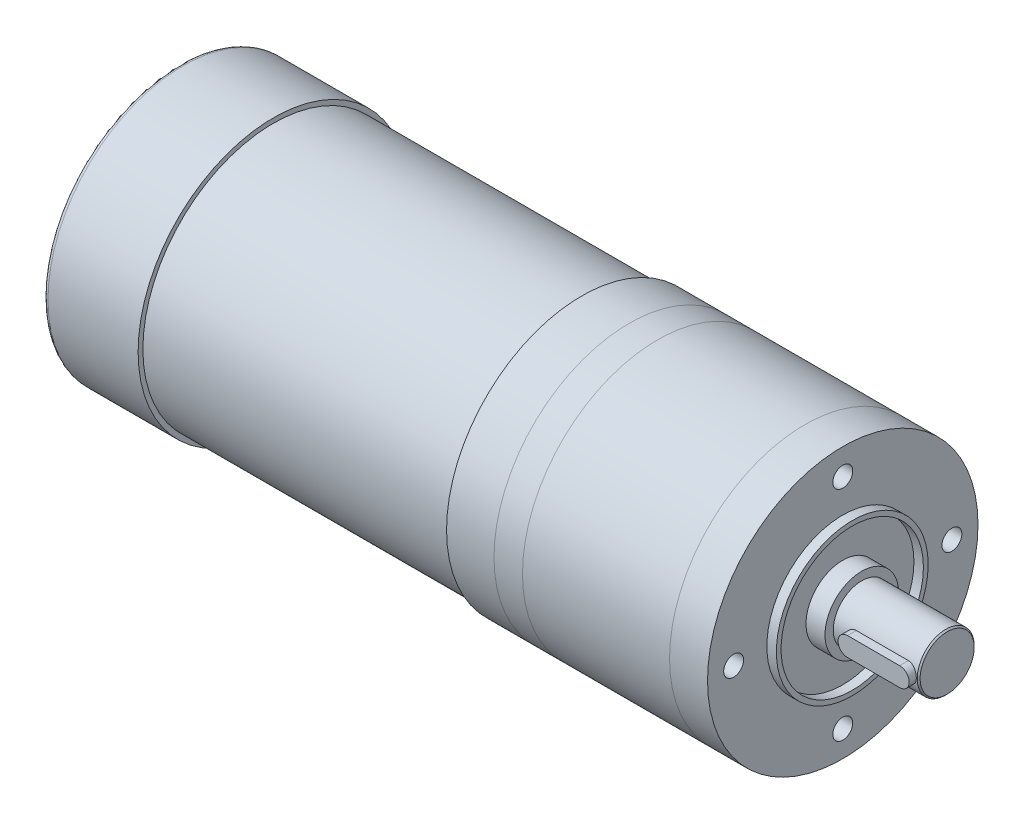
ISO-10303-21;
HEADER;
FILE_DESCRIPTION(('STEP AP214'),'2;1');
FILE_NAME('part.step','',(''),(''),'','','');
FILE_SCHEMA(('AUTOMOTIVE_DESIGN { 1 0 10303 214 1 1 1 1 }'));
ENDSEC;
DATA;
#1=APPLICATION_CONTEXT('core data for automotive mechanical design processes');
#2=APPLICATION_PROTOCOL_DEFINITION('international standard','automotive_design',2000,#1);
#3=PRODUCT_CONTEXT('',#1,'mechanical');
#4=PRODUCT('Part','Part','',(#3));
#5=PRODUCT_RELATED_PRODUCT_CATEGORY('part','',(#4));
#6=PRODUCT_DEFINITION_FORMATION('','',#4);
#7=PRODUCT_DEFINITION_CONTEXT('part definition',#1,'design');
#8=PRODUCT_DEFINITION('design','',#6,#7);
#9=PRODUCT_DEFINITION_SHAPE('','',#8);
#10=(LENGTH_UNIT() NAMED_UNIT(*) SI_UNIT(.MILLI.,.METRE.));
#11=(NAMED_UNIT(*) PLANE_ANGLE_UNIT() SI_UNIT($,.RADIAN.));
#12=(NAMED_UNIT(*) SI_UNIT($,.STERADIAN.) SOLID_ANGLE_UNIT());
#13=UNCERTAINTY_MEASURE_WITH_UNIT(LENGTH_MEASURE(1.E-05),#10,'distance_accuracy_value','');
#14=(GEOMETRIC_REPRESENTATION_CONTEXT(3) GLOBAL_UNCERTAINTY_ASSIGNED_CONTEXT((#13)) GLOBAL_UNIT_ASSIGNED_CONTEXT((#10,
#11,#12)) REPRESENTATION_CONTEXT('',''));
#15=CARTESIAN_POINT('',(0.,0.,0.));
#16=DIRECTION('',(0.,0.,1.));
#17=DIRECTION('',(1.,0.,0.));
#18=AXIS2_PLACEMENT_3D('',#15,#16,#17);
#19=CARTESIAN_POINT('',(8.5,0.,7.5));
#20=DIRECTION('',(0.,0.,-1.));
#21=DIRECTION('',(-1.,0.,0.));
#22=AXIS2_PLACEMENT_3D('',#19,#20,#21);
#23=CYLINDRICAL_SURFACE('',#22,2.);
#24=CARTESIAN_POINT('',(8.5,0.,3.5));
#25=DIRECTION('',(0.,0.,1.));
#26=DIRECTION('',(1.,0.,0.));
#27=AXIS2_PLACEMENT_3D('',#24,#25,#26);
#28=CIRCLE('',#27,2.);
#29=CARTESIAN_POINT('',(8.5,2.,3.5));
#30=VERTEX_POINT('',#29);
#31=CARTESIAN_POINT('',(8.5,-2.,3.5));
#32=VERTEX_POINT('',#31);
#33=EDGE_CURVE('E108',#30,#32,#28,.T.);
#34=ORIENTED_EDGE('',*,*,#33,.T.);
#35=DIRECTION('',(0.,0.,-1.));
#36=VECTOR('',#35,1.);
#37=CARTESIAN_POINT('',(8.5,-2.,7.5));
#38=LINE('',#37,#36);
#39=CARTESIAN_POINT('',(8.5,-2.,7.5));
#40=VERTEX_POINT('',#39);
#41=EDGE_CURVE('E12',#40,#32,#38,.T.);
#42=ORIENTED_EDGE('',*,*,#41,.F.);
#43=CARTESIAN_POINT('',(8.5,0.,7.5));
#44=DIRECTION('',(0.,0.,1.));
#45=DIRECTION('',(1.,0.,0.));
#46=AXIS2_PLACEMENT_3D('',#43,#44,#45);
#47=CIRCLE('',#46,2.);
#48=CARTESIAN_POINT('',(8.5,2.,7.5));
#49=VERTEX_POINT('',#48);
#50=EDGE_CURVE('E96',#49,#40,#47,.T.);
#51=ORIENTED_EDGE('',*,*,#50,.F.);
#52=DIRECTION('',(0.,0.,-1.));
#53=VECTOR('',#52,1.);
#54=CARTESIAN_POINT('',(8.5,2.,7.5));
#55=LINE('',#54,#53);
#56=EDGE_CURVE('E104',#49,#30,#55,.T.);
#57=ORIENTED_EDGE('',*,*,#56,.T.);
#58=EDGE_LOOP('',(#34,#42,#51,#57));
#59=FACE_BOUND('',#58,.T.);
#60=ADVANCED_FACE('F45',(#59),#23,.T.);
#61=CARTESIAN_POINT('',(19.5,-2.,7.5));
#62=DIRECTION('',(0.,1.,0.));
#63=DIRECTION('',(-1.,0.,0.));
#64=AXIS2_PLACEMENT_3D('',#61,#62,#63);
#65=PLANE('',#64);
#66=DIRECTION('',(1.,0.,0.));
#67=VECTOR('',#66,1.);
#68=CARTESIAN_POINT('',(19.5,-2.,3.5));
#69=LINE('',#68,#67);
#70=CARTESIAN_POINT('',(19.5,-2.,3.5));
#71=VERTEX_POINT('',#70);
#72=EDGE_CURVE('E100',#32,#71,#69,.T.);
#73=ORIENTED_EDGE('',*,*,#72,.T.);
#74=DIRECTION('',(0.,0.,-1.));
#75=VECTOR('',#74,1.);
#76=CARTESIAN_POINT('',(19.5,-2.,7.5));
#77=LINE('',#76,#75);
#78=CARTESIAN_POINT('',(19.5,-2.,7.5));
#79=VERTEX_POINT('',#78);
#80=EDGE_CURVE('E53',#79,#71,#77,.T.);
#81=ORIENTED_EDGE('',*,*,#80,.F.);
#82=DIRECTION('',(1.,0.,0.));
#83=VECTOR('',#82,1.);
#84=CARTESIAN_POINT('',(19.5,-2.,7.5));
#85=LINE('',#84,#83);
#86=EDGE_CURVE('E91',#40,#79,#85,.T.);
#87=ORIENTED_EDGE('',*,*,#86,.F.);
#88=ORIENTED_EDGE('',*,*,#41,.T.);
#89=EDGE_LOOP('',(#73,#81,#87,#88));
#90=FACE_BOUND('',#89,.T.);
#91=ADVANCED_FACE('F99',(#90),#65,.F.);
#92=CARTESIAN_POINT('',(19.5,0.,7.5));
#93=DIRECTION('',(0.,0.,-1.));
#94=DIRECTION('',(-1.,0.,0.));
#95=AXIS2_PLACEMENT_3D('',#92,#93,#94);
#96=CYLINDRICAL_SURFACE('',#95,2.);
#97=CARTESIAN_POINT('',(19.5,0.,3.5));
#98=DIRECTION('',(0.,0.,1.));
#99=DIRECTION('',(1.,0.,0.));
#100=AXIS2_PLACEMENT_3D('',#97,#98,#99);
#101=CIRCLE('',#100,2.);
#102=CARTESIAN_POINT('',(19.5,2.,3.5));
#103=VERTEX_POINT('',#102);
#104=EDGE_CURVE('E78',#71,#103,#101,.T.);
#105=ORIENTED_EDGE('',*,*,#104,.T.);
#106=DIRECTION('',(0.,0.,-1.));
#107=VECTOR('',#106,1.);
#108=CARTESIAN_POINT('',(19.5,2.,7.5));
#109=LINE('',#108,#107);
#110=CARTESIAN_POINT('',(19.5,2.,7.5));
#111=VERTEX_POINT('',#110);
#112=EDGE_CURVE('E101',#111,#103,#109,.T.);
#113=ORIENTED_EDGE('',*,*,#112,.F.);
#114=CARTESIAN_POINT('',(19.5,0.,7.5));
#115=DIRECTION('',(0.,0.,1.));
#116=DIRECTION('',(1.,0.,0.));
#117=AXIS2_PLACEMENT_3D('',#114,#115,#116);
#118=CIRCLE('',#117,2.);
#119=EDGE_CURVE('E94',#79,#111,#118,.T.);
#120=ORIENTED_EDGE('',*,*,#119,.F.);
#121=ORIENTED_EDGE('',*,*,#80,.T.);
#122=EDGE_LOOP('',(#105,#113,#120,#121));
#123=FACE_BOUND('',#122,.T.);
#124=ADVANCED_FACE('F102',(#123),#96,.T.);
#125=CARTESIAN_POINT('',(8.5,2.,7.5));
#126=DIRECTION('',(0.,-1.,0.));
#127=DIRECTION('',(1.,0.,0.));
#128=AXIS2_PLACEMENT_3D('',#125,#126,#127);
#129=PLANE('',#128);
#130=DIRECTION('',(-1.,0.,0.));
#131=VECTOR('',#130,1.);
#132=CARTESIAN_POINT('',(8.5,2.,3.5));
#133=LINE('',#132,#131);
#134=EDGE_CURVE('E84',#103,#30,#133,.T.);
#135=ORIENTED_EDGE('',*,*,#134,.T.);
#136=ORIENTED_EDGE('',*,*,#56,.F.);
#137=DIRECTION('',(-1.,0.,0.));
#138=VECTOR('',#137,1.);
#139=CARTESIAN_POINT('',(8.5,2.,7.5));
#140=LINE('',#139,#138);
#141=EDGE_CURVE('E61',#111,#49,#140,.T.);
#142=ORIENTED_EDGE('',*,*,#141,.F.);
#143=ORIENTED_EDGE('',*,*,#112,.T.);
#144=EDGE_LOOP('',(#135,#136,#142,#143));
#145=FACE_BOUND('',#144,.T.);
#146=ADVANCED_FACE('F115',(#145),#129,.F.);
#147=CARTESIAN_POINT('',(8.5,0.,7.5));
#148=DIRECTION('',(0.,0.,1.));
#149=DIRECTION('',(1.,0.,0.));
#150=AXIS2_PLACEMENT_3D('',#147,#148,#149);
#151=PLANE('',#150);
#152=ORIENTED_EDGE('',*,*,#50,.T.);
#153=ORIENTED_EDGE('',*,*,#86,.T.);
#154=ORIENTED_EDGE('',*,*,#119,.T.);
#155=ORIENTED_EDGE('',*,*,#141,.T.);
#156=EDGE_LOOP('',(#152,#153,#154,#155));
#157=FACE_BOUND('',#156,.T.);
#158=ADVANCED_FACE('F92',(#157),#151,.T.);
#159=CARTESIAN_POINT('',(8.5,0.,3.5));
#160=DIRECTION('',(0.,0.,1.));
#161=DIRECTION('',(1.,0.,0.));
#162=AXIS2_PLACEMENT_3D('',#159,#160,#161);
#163=PLANE('',#162);
#164=ORIENTED_EDGE('',*,*,#33,.F.);
#165=ORIENTED_EDGE('',*,*,#134,.F.);
#166=ORIENTED_EDGE('',*,*,#104,.F.);
#167=ORIENTED_EDGE('',*,*,#72,.F.);
#168=EDGE_LOOP('',(#164,#165,#166,#167));
#169=FACE_BOUND('',#168,.T.);
#170=ADVANCED_FACE('F118',(#169),#163,.F.);
#171=CLOSED_SHELL('',(#60,#91,#124,#146,#158,#170));
#172=MANIFOLD_SOLID_BREP('B2',#171);
#173=CARTESIAN_POINT('',(-55.,0.,0.));
#174=DIRECTION('',(-1.,0.,0.));
#175=DIRECTION('',(0.,0.,1.));
#176=AXIS2_PLACEMENT_3D('',#173,#174,#175);
#177=PLANE('',#176);
#178=CARTESIAN_POINT('',(-55.,0.,0.));
#179=DIRECTION('',(-1.,0.,0.));
#180=DIRECTION('',(0.,0.,1.));
#181=AXIS2_PLACEMENT_3D('',#178,#179,#180);
#182=CIRCLE('',#181,28.5);
#183=CARTESIAN_POINT('',(-55.,0.,28.5));
#184=VERTEX_POINT('',#183);
#185=EDGE_CURVE('E187',#184,#184,#182,.T.);
#186=ORIENTED_EDGE('',*,*,#185,.T.);
#187=EDGE_LOOP('',(#186));
#188=FACE_BOUND('',#187,.T.);
#189=CARTESIAN_POINT('',(-55.,0.,0.));
#190=DIRECTION('',(-1.,0.,0.));
#191=DIRECTION('',(0.,0.,1.));
#192=AXIS2_PLACEMENT_3D('',#189,#190,#191);
#193=CIRCLE('',#192,27.5);
#194=CARTESIAN_POINT('',(-55.,0.,27.5));
#195=VERTEX_POINT('',#194);
#196=EDGE_CURVE('E197',#195,#195,#193,.T.);
#197=ORIENTED_EDGE('',*,*,#196,.F.);
#198=EDGE_LOOP('',(#197));
#199=FACE_BOUND('',#198,.T.);
#200=ADVANCED_FACE('F176',(#188,#199),#177,.T.);
#201=CARTESIAN_POINT('',(-55.,0.,0.));
#202=DIRECTION('',(1.,0.,0.));
#203=DIRECTION('',(0.,0.,-1.));
#204=AXIS2_PLACEMENT_3D('',#201,#202,#203);
#205=CYLINDRICAL_SURFACE('',#204,28.5);
#206=ORIENTED_EDGE('',*,*,#185,.F.);
#207=EDGE_LOOP('',(#206));
#208=FACE_BOUND('',#207,.T.);
#209=CARTESIAN_POINT('',(-45.,0.,0.));
#210=DIRECTION('',(-1.,0.,0.));
#211=DIRECTION('',(0.,0.,1.));
#212=AXIS2_PLACEMENT_3D('',#209,#210,#211);
#213=CIRCLE('',#212,28.5);
#214=CARTESIAN_POINT('',(-45.,0.,28.5));
#215=VERTEX_POINT('',#214);
#216=EDGE_CURVE('E191',#215,#215,#213,.T.);
#217=ORIENTED_EDGE('',*,*,#216,.T.);
#218=EDGE_LOOP('',(#217));
#219=FACE_BOUND('',#218,.T.);
#220=ADVANCED_FACE('F222',(#208,#219),#205,.T.);
#221=CARTESIAN_POINT('',(-45.,0.,0.));
#222=DIRECTION('',(-1.,0.,0.));
#223=DIRECTION('',(0.,0.,1.));
#224=AXIS2_PLACEMENT_3D('',#221,#222,#223);
#225=PLANE('',#224);
#226=ORIENTED_EDGE('',*,*,#216,.F.);
#227=EDGE_LOOP('',(#226));
#228=FACE_BOUND('',#227,.T.);
#229=ADVANCED_FACE('F217',(#228),#225,.F.);
#230=CARTESIAN_POINT('',(-120.,0.,0.));
#231=DIRECTION('',(1.,0.,0.));
#232=DIRECTION('',(0.,0.,-1.));
#233=AXIS2_PLACEMENT_3D('',#230,#231,#232);
#234=CYLINDRICAL_SURFACE('',#233,27.5);
#235=CARTESIAN_POINT('',(-120.,0.,0.));
#236=DIRECTION('',(-1.,0.,0.));
#237=DIRECTION('',(0.,0.,1.));
#238=AXIS2_PLACEMENT_3D('',#235,#236,#237);
#239=CIRCLE('',#238,27.5);
#240=CARTESIAN_POINT('',(-120.,0.,27.5));
#241=VERTEX_POINT('',#240);
#242=EDGE_CURVE('E195',#241,#241,#239,.T.);
#243=ORIENTED_EDGE('',*,*,#242,.F.);
#244=EDGE_LOOP('',(#243));
#245=FACE_BOUND('',#244,.T.);
#246=ORIENTED_EDGE('',*,*,#196,.T.);
#247=EDGE_LOOP('',(#246));
#248=FACE_BOUND('',#247,.T.);
#249=ADVANCED_FACE('F211',(#245,#248),#234,.T.);
#250=CARTESIAN_POINT('',(-120.,0.,0.));
#251=DIRECTION('',(-1.,0.,0.));
#252=DIRECTION('',(0.,0.,1.));
#253=AXIS2_PLACEMENT_3D('',#250,#251,#252);
#254=PLANE('',#253);
#255=CARTESIAN_POINT('',(-120.,0.,0.));
#256=DIRECTION('',(-1.,0.,0.));
#257=DIRECTION('',(0.,0.,1.));
#258=AXIS2_PLACEMENT_3D('',#255,#256,#257);
#259=CIRCLE('',#258,28.5);
#260=CARTESIAN_POINT('',(-120.,0.,28.5));
#261=VERTEX_POINT('',#260);
#262=EDGE_CURVE('E200',#261,#261,#259,.T.);
#263=ORIENTED_EDGE('',*,*,#262,.F.);
#264=EDGE_LOOP('',(#263));
#265=FACE_BOUND('',#264,.T.);
#266=ORIENTED_EDGE('',*,*,#242,.T.);
#267=EDGE_LOOP('',(#266));
#268=FACE_BOUND('',#267,.T.);
#269=ADVANCED_FACE('F208',(#265,#268),#254,.F.);
#270=CARTESIAN_POINT('',(-140.,0.,0.));
#271=DIRECTION('',(1.,0.,0.));
#272=DIRECTION('',(0.,0.,-1.));
#273=AXIS2_PLACEMENT_3D('',#270,#271,#272);
#274=CYLINDRICAL_SURFACE('',#273,28.5);
#275=CARTESIAN_POINT('',(-139.,0.,0.));
#276=DIRECTION('',(-1.,0.,0.));
#277=DIRECTION('',(0.,0.,1.));
#278=AXIS2_PLACEMENT_3D('',#275,#276,#277);
#279=CIRCLE('',#278,28.5);
#280=CARTESIAN_POINT('',(-139.,0.,28.5));
#281=VERTEX_POINT('',#280);
#282=EDGE_CURVE('E44',#281,#281,#279,.F.);
#283=ORIENTED_EDGE('',*,*,#282,.T.);
#284=EDGE_LOOP('',(#283));
#285=FACE_BOUND('',#284,.T.);
#286=ORIENTED_EDGE('',*,*,#262,.T.);
#287=EDGE_LOOP('',(#286));
#288=FACE_BOUND('',#287,.T.);
#289=ADVANCED_FACE('F206',(#285,#288),#274,.T.);
#290=CARTESIAN_POINT('',(-140.,0.,0.));
#291=DIRECTION('',(-1.,0.,0.));
#292=DIRECTION('',(0.,0.,1.));
#293=AXIS2_PLACEMENT_3D('',#290,#291,#292);
#294=PLANE('',#293);
#295=CARTESIAN_POINT('',(-140.,0.,0.));
#296=DIRECTION('',(-1.,0.,0.));
#297=DIRECTION('',(0.,0.,1.));
#298=AXIS2_PLACEMENT_3D('',#295,#296,#297);
#299=CIRCLE('',#298,27.5);
#300=CARTESIAN_POINT('',(-140.,0.,27.5));
#301=VERTEX_POINT('',#300);
#302=EDGE_CURVE('E183',#301,#301,#299,.T.);
#303=ORIENTED_EDGE('',*,*,#302,.T.);
#304=EDGE_LOOP('',(#303));
#305=FACE_BOUND('',#304,.T.);
#306=ADVANCED_FACE('F253',(#305),#294,.T.);
#307=CARTESIAN_POINT('',(-139.,0.,0.));
#308=DIRECTION('',(-1.,0.,0.));
#309=DIRECTION('',(0.,0.,1.));
#310=AXIS2_PLACEMENT_3D('',#307,#308,#309);
#311=TOROIDAL_SURFACE('',#310,27.5,1.);
#312=ORIENTED_EDGE('',*,*,#282,.F.);
#313=EDGE_LOOP('',(#312));
#314=FACE_BOUND('',#313,.T.);
#315=ORIENTED_EDGE('',*,*,#302,.F.);
#316=EDGE_LOOP('',(#315));
#317=FACE_BOUND('',#316,.T.);
#318=ADVANCED_FACE('F178',(#314,#317),#311,.T.);
#319=CLOSED_SHELL('',(#200,#220,#229,#249,#269,#289,#306,#318));
#320=MANIFOLD_SOLID_BREP('B6',#319);
#321=CARTESIAN_POINT('',(-45.,0.,0.));
#322=DIRECTION('',(1.,0.,0.));
#323=DIRECTION('',(0.,0.,-1.));
#324=AXIS2_PLACEMENT_3D('',#321,#322,#323);
#325=CYLINDRICAL_SURFACE('',#324,28.5);
#326=CARTESIAN_POINT('',(-45.,0.,0.));
#327=DIRECTION('',(-1.,0.,0.));
#328=DIRECTION('',(0.,0.,1.));
#329=AXIS2_PLACEMENT_3D('',#326,#327,#328);
#330=CIRCLE('',#329,28.5);
#331=CARTESIAN_POINT('',(-45.,0.,28.5));
#332=VERTEX_POINT('',#331);
#333=EDGE_CURVE('E175',#332,#332,#330,.T.);
#334=ORIENTED_EDGE('',*,*,#333,.F.);
#335=EDGE_LOOP('',(#334));
#336=FACE_BOUND('',#335,.T.);
#337=CARTESIAN_POINT('',(-39.,0.,0.));
#338=DIRECTION('',(-1.,0.,0.));
#339=DIRECTION('',(0.,0.,1.));
#340=AXIS2_PLACEMENT_3D('',#337,#338,#339);
#341=CIRCLE('',#340,28.5);
#342=CARTESIAN_POINT('',(-39.,0.,28.5));
#343=VERTEX_POINT('',#342);
#344=EDGE_CURVE('E304',#343,#343,#341,.T.);
#345=ORIENTED_EDGE('',*,*,#344,.T.);
#346=EDGE_LOOP('',(#345));
#347=FACE_BOUND('',#346,.T.);
#348=ADVANCED_FACE('F301',(#336,#347),#325,.T.);
#349=CARTESIAN_POINT('',(-45.,0.,0.));
#350=DIRECTION('',(-1.,0.,0.));
#351=DIRECTION('',(0.,0.,1.));
#352=AXIS2_PLACEMENT_3D('',#349,#350,#351);
#353=PLANE('',#352);
#354=ORIENTED_EDGE('',*,*,#333,.T.);
#355=EDGE_LOOP('',(#354));
#356=FACE_BOUND('',#355,.T.);
#357=ADVANCED_FACE('F316',(#356),#353,.T.);
#358=CARTESIAN_POINT('',(-39.,0.,0.));
#359=DIRECTION('',(-1.,0.,0.));
#360=DIRECTION('',(0.,0.,1.));
#361=AXIS2_PLACEMENT_3D('',#358,#359,#360);
#362=PLANE('',#361);
#363=ORIENTED_EDGE('',*,*,#344,.F.);
#364=EDGE_LOOP('',(#363));
#365=FACE_BOUND('',#364,.T.);
#366=ADVANCED_FACE('F314',(#365),#362,.F.);
#367=CLOSED_SHELL('',(#348,#357,#366));
#368=MANIFOLD_SOLID_BREP('B39',#367);
#369=CARTESIAN_POINT('',(-39.,0.,0.));
#370=DIRECTION('',(1.,0.,0.));
#371=DIRECTION('',(0.,0.,-1.));
#372=AXIS2_PLACEMENT_3D('',#369,#370,#371);
#373=CYLINDRICAL_SURFACE('',#372,28.5);
#374=CARTESIAN_POINT('',(-39.,0.,0.));
#375=DIRECTION('',(-1.,0.,0.));
#376=DIRECTION('',(0.,0.,1.));
#377=AXIS2_PLACEMENT_3D('',#374,#375,#376);
#378=CIRCLE('',#377,28.5);
#379=CARTESIAN_POINT('',(-39.,0.,28.5));
#380=VERTEX_POINT('',#379);
#381=EDGE_CURVE('E299',#380,#380,#378,.T.);
#382=ORIENTED_EDGE('',*,*,#381,.F.);
#383=EDGE_LOOP('',(#382));
#384=FACE_BOUND('',#383,.T.);
#385=CARTESIAN_POINT('',(-8.,0.,0.));
#386=DIRECTION('',(-1.,0.,0.));
#387=DIRECTION('',(0.,0.,1.));
#388=AXIS2_PLACEMENT_3D('',#385,#386,#387);
#389=CIRCLE('',#388,28.5);
#390=CARTESIAN_POINT('',(-8.,0.,28.5));
#391=VERTEX_POINT('',#390);
#392=EDGE_CURVE('E358',#391,#391,#389,.T.);
#393=ORIENTED_EDGE('',*,*,#392,.T.);
#394=EDGE_LOOP('',(#393));
#395=FACE_BOUND('',#394,.T.);
#396=ADVANCED_FACE('F350',(#384,#395),#373,.T.);
#397=CARTESIAN_POINT('',(-39.,0.,0.));
#398=DIRECTION('',(-1.,0.,0.));
#399=DIRECTION('',(0.,0.,1.));
#400=AXIS2_PLACEMENT_3D('',#397,#398,#399);
#401=PLANE('',#400);
#402=ORIENTED_EDGE('',*,*,#381,.T.);
#403=EDGE_LOOP('',(#402));
#404=FACE_BOUND('',#403,.T.);
#405=ADVANCED_FACE('F423',(#404),#401,.T.);
#406=CARTESIAN_POINT('',(-8.,0.,0.));
#407=DIRECTION('',(-1.,0.,0.));
#408=DIRECTION('',(0.,0.,1.));
#409=AXIS2_PLACEMENT_3D('',#406,#407,#408);
#410=PLANE('',#409);
#411=CARTESIAN_POINT('',(-8.,23.,0.));
#412=DIRECTION('',(-1.,0.,0.));
#413=DIRECTION('',(0.,0.,1.));
#414=AXIS2_PLACEMENT_3D('',#411,#412,#413);
#415=CIRCLE('',#414,2.1);
#416=CARTESIAN_POINT('',(-8.,23.,2.1));
#417=VERTEX_POINT('',#416);
#418=EDGE_CURVE('E353',#417,#417,#415,.T.);
#419=ORIENTED_EDGE('',*,*,#418,.T.);
#420=EDGE_LOOP('',(#419));
#421=FACE_BOUND('',#420,.T.);
#422=CARTESIAN_POINT('',(-8.,0.,-23.));
#423=DIRECTION('',(-1.,0.,0.));
#424=DIRECTION('',(0.,0.,1.));
#425=AXIS2_PLACEMENT_3D('',#422,#423,#424);
#426=CIRCLE('',#425,2.1);
#427=CARTESIAN_POINT('',(-8.,0.,-20.9));
#428=VERTEX_POINT('',#427);
#429=EDGE_CURVE('E387',#428,#428,#426,.T.);
#430=ORIENTED_EDGE('',*,*,#429,.T.);
#431=EDGE_LOOP('',(#430));
#432=FACE_BOUND('',#431,.T.);
#433=CARTESIAN_POINT('',(-8.,-23.,0.));
#434=DIRECTION('',(-1.,0.,0.));
#435=DIRECTION('',(0.,0.,1.));
#436=AXIS2_PLACEMENT_3D('',#433,#434,#435);
#437=CIRCLE('',#436,2.1);
#438=CARTESIAN_POINT('',(-8.,-23.,2.1));
#439=VERTEX_POINT('',#438);
#440=EDGE_CURVE('E391',#439,#439,#437,.T.);
#441=ORIENTED_EDGE('',*,*,#440,.T.);
#442=EDGE_LOOP('',(#441));
#443=FACE_BOUND('',#442,.T.);
#444=CARTESIAN_POINT('',(-8.,0.,23.));
#445=DIRECTION('',(-1.,0.,0.));
#446=DIRECTION('',(0.,0.,1.));
#447=AXIS2_PLACEMENT_3D('',#444,#445,#446);
#448=CIRCLE('',#447,2.1);
#449=CARTESIAN_POINT('',(-8.,0.,25.1));
#450=VERTEX_POINT('',#449);
#451=EDGE_CURVE('E394',#450,#450,#448,.T.);
#452=ORIENTED_EDGE('',*,*,#451,.T.);
#453=EDGE_LOOP('',(#452));
#454=FACE_BOUND('',#453,.T.);
#455=ORIENTED_EDGE('',*,*,#392,.F.);
#456=EDGE_LOOP('',(#455));
#457=FACE_BOUND('',#456,.T.);
#458=ADVANCED_FACE('F404',(#421,#432,#443,#454,#457),#410,.F.);
#459=CARTESIAN_POINT('',(0.,0.,23.));
#460=DIRECTION('',(1.,0.,0.));
#461=DIRECTION('',(0.,0.,-1.));
#462=AXIS2_PLACEMENT_3D('',#459,#460,#461);
#463=CYLINDRICAL_SURFACE('',#462,2.1);
#464=CARTESIAN_POINT('',(-14.,0.,23.));
#465=DIRECTION('',(1.,0.,0.));
#466=DIRECTION('',(0.,0.,-1.));
#467=AXIS2_PLACEMENT_3D('',#464,#465,#466);
#468=CIRCLE('',#467,2.1);
#469=CARTESIAN_POINT('',(-14.,0.,20.9));
#470=VERTEX_POINT('',#469);
#471=EDGE_CURVE('E392',#470,#470,#468,.T.);
#472=ORIENTED_EDGE('',*,*,#471,.F.);
#473=EDGE_LOOP('',(#472));
#474=FACE_BOUND('',#473,.T.);
#475=ORIENTED_EDGE('',*,*,#451,.F.);
#476=EDGE_LOOP('',(#475));
#477=FACE_BOUND('',#476,.T.);
#478=ADVANCED_FACE('F435',(#474,#477),#463,.F.);
#479=CARTESIAN_POINT('',(-14.,0.,23.));
#480=DIRECTION('',(1.,0.,0.));
#481=DIRECTION('',(0.,0.,-1.));
#482=AXIS2_PLACEMENT_3D('',#479,#480,#481);
#483=CONICAL_SURFACE('',#482,2.1,1.02974425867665);
#484=CARTESIAN_POINT('',(-15.2618072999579,0.,23.));
#485=VERTEX_POINT('',#484);
#486=VERTEX_LOOP('',#485);
#487=FACE_BOUND('',#486,.T.);
#488=ORIENTED_EDGE('',*,*,#471,.T.);
#489=EDGE_LOOP('',(#488));
#490=FACE_BOUND('',#489,.T.);
#491=ADVANCED_FACE('F440',(#487,#490),#483,.F.);
#492=CARTESIAN_POINT('',(0.,-23.,0.));
#493=DIRECTION('',(1.,0.,0.));
#494=DIRECTION('',(0.,0.,-1.));
#495=AXIS2_PLACEMENT_3D('',#492,#493,#494);
#496=CYLINDRICAL_SURFACE('',#495,2.1);
#497=CARTESIAN_POINT('',(-14.,-23.,0.));
#498=DIRECTION('',(1.,0.,0.));
#499=DIRECTION('',(0.,0.,-1.));
#500=AXIS2_PLACEMENT_3D('',#497,#498,#499);
#501=CIRCLE('',#500,2.1);
#502=CARTESIAN_POINT('',(-14.,-23.,-2.1));
#503=VERTEX_POINT('',#502);
#504=EDGE_CURVE('E388',#503,#503,#501,.T.);
#505=ORIENTED_EDGE('',*,*,#504,.F.);
#506=EDGE_LOOP('',(#505));
#507=FACE_BOUND('',#506,.T.);
#508=ORIENTED_EDGE('',*,*,#440,.F.);
#509=EDGE_LOOP('',(#508));
#510=FACE_BOUND('',#509,.T.);
#511=ADVANCED_FACE('F419',(#507,#510),#496,.F.);
#512=CARTESIAN_POINT('',(-14.,-23.,0.));
#513=DIRECTION('',(1.,0.,0.));
#514=DIRECTION('',(0.,0.,-1.));
#515=AXIS2_PLACEMENT_3D('',#512,#513,#514);
#516=CONICAL_SURFACE('',#515,2.1,1.02974425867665);
#517=CARTESIAN_POINT('',(-15.2618072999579,-23.,0.));
#518=VERTEX_POINT('',#517);
#519=VERTEX_LOOP('',#518);
#520=FACE_BOUND('',#519,.T.);
#521=ORIENTED_EDGE('',*,*,#504,.T.);
#522=EDGE_LOOP('',(#521));
#523=FACE_BOUND('',#522,.T.);
#524=ADVANCED_FACE('F410',(#520,#523),#516,.F.);
#525=CARTESIAN_POINT('',(0.,0.,-23.));
#526=DIRECTION('',(1.,0.,0.));
#527=DIRECTION('',(0.,0.,-1.));
#528=AXIS2_PLACEMENT_3D('',#525,#526,#527);
#529=CYLINDRICAL_SURFACE('',#528,2.1);
#530=CARTESIAN_POINT('',(-14.,0.,-23.));
#531=DIRECTION('',(1.,0.,0.));
#532=DIRECTION('',(0.,0.,-1.));
#533=AXIS2_PLACEMENT_3D('',#530,#531,#532);
#534=CIRCLE('',#533,2.1);
#535=CARTESIAN_POINT('',(-14.,0.,-25.1));
#536=VERTEX_POINT('',#535);
#537=EDGE_CURVE('E383',#536,#536,#534,.T.);
#538=ORIENTED_EDGE('',*,*,#537,.F.);
#539=EDGE_LOOP('',(#538));
#540=FACE_BOUND('',#539,.T.);
#541=ORIENTED_EDGE('',*,*,#429,.F.);
#542=EDGE_LOOP('',(#541));
#543=FACE_BOUND('',#542,.T.);
#544=ADVANCED_FACE('F407',(#540,#543),#529,.F.);
#545=CARTESIAN_POINT('',(-14.,0.,-23.));
#546=DIRECTION('',(1.,0.,0.));
#547=DIRECTION('',(0.,0.,-1.));
#548=AXIS2_PLACEMENT_3D('',#545,#546,#547);
#549=CONICAL_SURFACE('',#548,2.1,1.02974425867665);
#550=CARTESIAN_POINT('',(-15.2618072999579,0.,-23.));
#551=VERTEX_POINT('',#550);
#552=VERTEX_LOOP('',#551);
#553=FACE_BOUND('',#552,.T.);
#554=ORIENTED_EDGE('',*,*,#537,.T.);
#555=EDGE_LOOP('',(#554));
#556=FACE_BOUND('',#555,.T.);
#557=ADVANCED_FACE('F409',(#553,#556),#549,.F.);
#558=CARTESIAN_POINT('',(0.,23.,0.));
#559=DIRECTION('',(1.,0.,0.));
#560=DIRECTION('',(0.,0.,-1.));
#561=AXIS2_PLACEMENT_3D('',#558,#559,#560);
#562=CYLINDRICAL_SURFACE('',#561,2.1);
#563=CARTESIAN_POINT('',(-14.,23.,0.));
#564=DIRECTION('',(1.,0.,0.));
#565=DIRECTION('',(0.,0.,-1.));
#566=AXIS2_PLACEMENT_3D('',#563,#564,#565);
#567=CIRCLE('',#566,2.1);
#568=CARTESIAN_POINT('',(-14.,23.,-2.1));
#569=VERTEX_POINT('',#568);
#570=EDGE_CURVE('E379',#569,#569,#567,.T.);
#571=ORIENTED_EDGE('',*,*,#570,.F.);
#572=EDGE_LOOP('',(#571));
#573=FACE_BOUND('',#572,.T.);
#574=ORIENTED_EDGE('',*,*,#418,.F.);
#575=EDGE_LOOP('',(#574));
#576=FACE_BOUND('',#575,.T.);
#577=ADVANCED_FACE('F375',(#573,#576),#562,.F.);
#578=CARTESIAN_POINT('',(-14.,23.,0.));
#579=DIRECTION('',(1.,0.,0.));
#580=DIRECTION('',(0.,0.,-1.));
#581=AXIS2_PLACEMENT_3D('',#578,#579,#580);
#582=CONICAL_SURFACE('',#581,2.1,1.02974425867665);
#583=CARTESIAN_POINT('',(-15.2618072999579,23.,0.));
#584=VERTEX_POINT('',#583);
#585=VERTEX_LOOP('',#584);
#586=FACE_BOUND('',#585,.T.);
#587=ORIENTED_EDGE('',*,*,#570,.T.);
#588=EDGE_LOOP('',(#587));
#589=FACE_BOUND('',#588,.T.);
#590=ADVANCED_FACE('F372',(#586,#589),#582,.F.);
#591=CLOSED_SHELL('',(#396,#405,#458,#478,#491,#511,#524,#544,#557,#577,#590));
#592=MANIFOLD_SOLID_BREP('B170',#591);
#593=CARTESIAN_POINT('',(4.,0.,0.));
#594=DIRECTION('',(1.,0.,0.));
#595=DIRECTION('',(0.,0.,-1.));
#596=AXIS2_PLACEMENT_3D('',#593,#594,#595);
#597=PLANE('',#596);
#598=CARTESIAN_POINT('',(4.,0.,0.));
#599=DIRECTION('',(1.,0.,0.));
#600=DIRECTION('',(0.,0.,-1.));
#601=AXIS2_PLACEMENT_3D('',#598,#599,#600);
#602=CIRCLE('',#601,7.75);
#603=CARTESIAN_POINT('',(4.,0.,-7.75));
#604=VERTEX_POINT('',#603);
#605=EDGE_CURVE('E637',#604,#604,#602,.T.);
#606=ORIENTED_EDGE('',*,*,#605,.T.);
#607=EDGE_LOOP('',(#606));
#608=FACE_BOUND('',#607,.T.);
#609=CARTESIAN_POINT('',(4.,0.,0.));
#610=DIRECTION('',(1.,0.,0.));
#611=DIRECTION('',(0.,0.,-1.));
#612=AXIS2_PLACEMENT_3D('',#609,#610,#611);
#613=CIRCLE('',#612,6.);
#614=CARTESIAN_POINT('',(4.,0.,-6.));
#615=VERTEX_POINT('',#614);
#616=EDGE_CURVE('E633',#615,#615,#613,.T.);
#617=ORIENTED_EDGE('',*,*,#616,.F.);
#618=EDGE_LOOP('',(#617));
#619=FACE_BOUND('',#618,.T.);
#620=ADVANCED_FACE('F540',(#608,#619),#597,.T.);
#621=CARTESIAN_POINT('',(0.,0.,0.));
#622=DIRECTION('',(1.,0.,0.));
#623=DIRECTION('',(0.,0.,-1.));
#624=AXIS2_PLACEMENT_3D('',#621,#622,#623);
#625=PLANE('',#624);
#626=CARTESIAN_POINT('',(0.,0.,0.));
#627=DIRECTION('',(1.,0.,0.));
#628=DIRECTION('',(0.,0.,-1.));
#629=AXIS2_PLACEMENT_3D('',#626,#627,#628);
#630=CIRCLE('',#629,15.);
#631=CARTESIAN_POINT('',(0.,0.,-15.));
#632=VERTEX_POINT('',#631);
#633=EDGE_CURVE('E655',#632,#632,#630,.F.);
#634=ORIENTED_EDGE('',*,*,#633,.F.);
#635=EDGE_LOOP('',(#634));
#636=FACE_BOUND('',#635,.T.);
#637=CARTESIAN_POINT('',(0.,0.,0.));
#638=DIRECTION('',(1.,0.,0.));
#639=DIRECTION('',(0.,0.,-1.));
#640=AXIS2_PLACEMENT_3D('',#637,#638,#639);
#641=CIRCLE('',#640,7.75);
#642=CARTESIAN_POINT('',(0.,0.,-7.75));
#643=VERTEX_POINT('',#642);
#644=EDGE_CURVE('E636',#643,#643,#641,.T.);
#645=ORIENTED_EDGE('',*,*,#644,.F.);
#646=EDGE_LOOP('',(#645));
#647=FACE_BOUND('',#646,.T.);
#648=ADVANCED_FACE('F716',(#636,#647),#625,.T.);
#649=CARTESIAN_POINT('',(0.,23.,0.));
#650=DIRECTION('',(1.,0.,0.));
#651=DIRECTION('',(0.,0.,-1.));
#652=AXIS2_PLACEMENT_3D('',#649,#650,#651);
#653=CIRCLE('',#652,2.1);
#654=CARTESIAN_POINT('',(0.,23.,-2.1));
#655=VERTEX_POINT('',#654);
#656=EDGE_CURVE('E608',#655,#655,#653,.T.);
#657=ORIENTED_EDGE('',*,*,#656,.F.);
#658=EDGE_LOOP('',(#657));
#659=FACE_BOUND('',#658,.T.);
#660=CARTESIAN_POINT('',(0.,0.,-23.));
#661=DIRECTION('',(1.,0.,0.));
#662=DIRECTION('',(0.,0.,-1.));
#663=AXIS2_PLACEMENT_3D('',#660,#661,#662);
#664=CIRCLE('',#663,2.1);
#665=CARTESIAN_POINT('',(0.,0.,-25.1));
#666=VERTEX_POINT('',#665);
#667=EDGE_CURVE('E617',#666,#666,#664,.T.);
#668=ORIENTED_EDGE('',*,*,#667,.F.);
#669=EDGE_LOOP('',(#668));
#670=FACE_BOUND('',#669,.T.);
#671=CARTESIAN_POINT('',(0.,-23.,0.));
#672=DIRECTION('',(1.,0.,0.));
#673=DIRECTION('',(0.,0.,-1.));
#674=AXIS2_PLACEMENT_3D('',#671,#672,#673);
#675=CIRCLE('',#674,2.1);
#676=CARTESIAN_POINT('',(0.,-23.,-2.1));
#677=VERTEX_POINT('',#676);
#678=EDGE_CURVE('E623',#677,#677,#675,.T.);
#679=ORIENTED_EDGE('',*,*,#678,.F.);
#680=EDGE_LOOP('',(#679));
#681=FACE_BOUND('',#680,.T.);
#682=CARTESIAN_POINT('',(0.,0.,23.));
#683=DIRECTION('',(1.,0.,0.));
#684=DIRECTION('',(0.,0.,-1.));
#685=AXIS2_PLACEMENT_3D('',#682,#683,#684);
#686=CIRCLE('',#685,2.1);
#687=CARTESIAN_POINT('',(0.,0.,20.9));
#688=VERTEX_POINT('',#687);
#689=EDGE_CURVE('E629',#688,#688,#686,.T.);
#690=ORIENTED_EDGE('',*,*,#689,.F.);
#691=EDGE_LOOP('',(#690));
#692=FACE_BOUND('',#691,.T.);
#693=CARTESIAN_POINT('',(0.,0.,0.));
#694=DIRECTION('',(1.,0.,0.));
#695=DIRECTION('',(0.,0.,-1.));
#696=AXIS2_PLACEMENT_3D('',#693,#694,#695);
#697=CIRCLE('',#696,28.5);
#698=CARTESIAN_POINT('',(0.,0.,-28.5));
#699=VERTEX_POINT('',#698);
#700=EDGE_CURVE('E649',#699,#699,#697,.T.);
#701=ORIENTED_EDGE('',*,*,#700,.T.);
#702=EDGE_LOOP('',(#701));
#703=FACE_BOUND('',#702,.T.);
#704=CARTESIAN_POINT('',(0.,0.,0.));
#705=DIRECTION('',(1.,0.,0.));
#706=DIRECTION('',(0.,0.,-1.));
#707=AXIS2_PLACEMENT_3D('',#704,#705,#706);
#708=CIRCLE('',#707,16.);
#709=CARTESIAN_POINT('',(0.,0.,-16.));
#710=VERTEX_POINT('',#709);
#711=EDGE_CURVE('E645',#710,#710,#708,.T.);
#712=ORIENTED_EDGE('',*,*,#711,.F.);
#713=EDGE_LOOP('',(#712));
#714=FACE_BOUND('',#713,.T.);
#715=ADVANCED_FACE('F721',(#659,#670,#681,#692,#703,#714),#625,.T.);
#716=CARTESIAN_POINT('',(-8.,0.,0.));
#717=DIRECTION('',(1.,0.,0.));
#718=DIRECTION('',(0.,0.,-1.));
#719=AXIS2_PLACEMENT_3D('',#716,#717,#718);
#720=CYLINDRICAL_SURFACE('',#719,28.5);
#721=CARTESIAN_POINT('',(-8.,0.,0.));
#722=DIRECTION('',(1.,0.,0.));
#723=DIRECTION('',(0.,0.,-1.));
#724=AXIS2_PLACEMENT_3D('',#721,#722,#723);
#725=CIRCLE('',#724,28.5);
#726=CARTESIAN_POINT('',(-8.,0.,-28.5));
#727=VERTEX_POINT('',#726);
#728=EDGE_CURVE('E652',#727,#727,#725,.T.);
#729=ORIENTED_EDGE('',*,*,#728,.T.);
#730=EDGE_LOOP('',(#729));
#731=FACE_BOUND('',#730,.T.);
#732=ORIENTED_EDGE('',*,*,#700,.F.);
#733=EDGE_LOOP('',(#732));
#734=FACE_BOUND('',#733,.T.);
#735=ADVANCED_FACE('F743',(#731,#734),#720,.T.);
#736=CARTESIAN_POINT('',(-8.,0.,0.));
#737=DIRECTION('',(1.,0.,0.));
#738=DIRECTION('',(0.,0.,-1.));
#739=AXIS2_PLACEMENT_3D('',#736,#737,#738);
#740=PLANE('',#739);
#741=CARTESIAN_POINT('',(-8.,23.,0.));
#742=DIRECTION('',(1.,0.,0.));
#743=DIRECTION('',(0.,0.,-1.));
#744=AXIS2_PLACEMENT_3D('',#741,#742,#743);
#745=CIRCLE('',#744,2.1);
#746=CARTESIAN_POINT('',(-8.,23.,-2.1));
#747=VERTEX_POINT('',#746);
#748=EDGE_CURVE('E614',#747,#747,#745,.T.);
#749=ORIENTED_EDGE('',*,*,#748,.T.);
#750=EDGE_LOOP('',(#749));
#751=FACE_BOUND('',#750,.T.);
#752=CARTESIAN_POINT('',(-8.,0.,-23.));
#753=DIRECTION('',(1.,0.,0.));
#754=DIRECTION('',(0.,0.,-1.));
#755=AXIS2_PLACEMENT_3D('',#752,#753,#754);
#756=CIRCLE('',#755,2.1);
#757=CARTESIAN_POINT('',(-8.,0.,-25.1));
#758=VERTEX_POINT('',#757);
#759=EDGE_CURVE('E620',#758,#758,#756,.T.);
#760=ORIENTED_EDGE('',*,*,#759,.T.);
#761=EDGE_LOOP('',(#760));
#762=FACE_BOUND('',#761,.T.);
#763=CARTESIAN_POINT('',(-8.,-23.,0.));
#764=DIRECTION('',(1.,0.,0.));
#765=DIRECTION('',(0.,0.,-1.));
#766=AXIS2_PLACEMENT_3D('',#763,#764,#765);
#767=CIRCLE('',#766,2.1);
#768=CARTESIAN_POINT('',(-8.,-23.,-2.1));
#769=VERTEX_POINT('',#768);
#770=EDGE_CURVE('E626',#769,#769,#767,.T.);
#771=ORIENTED_EDGE('',*,*,#770,.T.);
#772=EDGE_LOOP('',(#771));
#773=FACE_BOUND('',#772,.T.);
#774=CARTESIAN_POINT('',(-8.,0.,23.));
#775=DIRECTION('',(1.,0.,0.));
#776=DIRECTION('',(0.,0.,-1.));
#777=AXIS2_PLACEMENT_3D('',#774,#775,#776);
#778=CIRCLE('',#777,2.1);
#779=CARTESIAN_POINT('',(-8.,0.,20.9));
#780=VERTEX_POINT('',#779);
#781=EDGE_CURVE('E632',#780,#780,#778,.T.);
#782=ORIENTED_EDGE('',*,*,#781,.T.);
#783=EDGE_LOOP('',(#782));
#784=FACE_BOUND('',#783,.T.);
#785=ORIENTED_EDGE('',*,*,#728,.F.);
#786=EDGE_LOOP('',(#785));
#787=FACE_BOUND('',#786,.T.);
#788=ADVANCED_FACE('F737',(#751,#762,#773,#784,#787),#740,.F.);
#789=CARTESIAN_POINT('',(2.,0.,0.));
#790=DIRECTION('',(1.,0.,0.));
#791=DIRECTION('',(0.,0.,-1.));
#792=AXIS2_PLACEMENT_3D('',#789,#790,#791);
#793=PLANE('',#792);
#794=CARTESIAN_POINT('',(2.,0.,0.));
#795=DIRECTION('',(1.,0.,0.));
#796=DIRECTION('',(0.,0.,-1.));
#797=AXIS2_PLACEMENT_3D('',#794,#795,#796);
#798=CIRCLE('',#797,16.);
#799=CARTESIAN_POINT('',(2.,0.,-16.));
#800=VERTEX_POINT('',#799);
#801=EDGE_CURVE('E646',#800,#800,#798,.T.);
#802=ORIENTED_EDGE('',*,*,#801,.T.);
#803=EDGE_LOOP('',(#802));
#804=FACE_BOUND('',#803,.T.);
#805=CARTESIAN_POINT('',(2.,0.,0.));
#806=DIRECTION('',(1.,0.,0.));
#807=DIRECTION('',(0.,0.,-1.));
#808=AXIS2_PLACEMENT_3D('',#805,#806,#807);
#809=CIRCLE('',#808,15.);
#810=CARTESIAN_POINT('',(2.,0.,-15.));
#811=VERTEX_POINT('',#810);
#812=EDGE_CURVE('E640',#811,#811,#809,.T.);
#813=ORIENTED_EDGE('',*,*,#812,.F.);
#814=EDGE_LOOP('',(#813));
#815=FACE_BOUND('',#814,.T.);
#816=ADVANCED_FACE('F734',(#804,#815),#793,.T.);
#817=CARTESIAN_POINT('',(2.,0.,0.));
#818=DIRECTION('',(-1.,0.,0.));
#819=DIRECTION('',(0.,0.,1.));
#820=AXIS2_PLACEMENT_3D('',#817,#818,#819);
#821=CYLINDRICAL_SURFACE('',#820,16.);
#822=ORIENTED_EDGE('',*,*,#801,.F.);
#823=EDGE_LOOP('',(#822));
#824=FACE_BOUND('',#823,.T.);
#825=ORIENTED_EDGE('',*,*,#711,.T.);
#826=EDGE_LOOP('',(#825));
#827=FACE_BOUND('',#826,.T.);
#828=ADVANCED_FACE('F732',(#824,#827),#821,.T.);
#829=CARTESIAN_POINT('',(2.,0.,0.));
#830=DIRECTION('',(-1.,0.,0.));
#831=DIRECTION('',(0.,0.,1.));
#832=AXIS2_PLACEMENT_3D('',#829,#830,#831);
#833=CYLINDRICAL_SURFACE('',#832,15.);
#834=ORIENTED_EDGE('',*,*,#812,.T.);
#835=EDGE_LOOP('',(#834));
#836=FACE_BOUND('',#835,.T.);
#837=ORIENTED_EDGE('',*,*,#633,.T.);
#838=EDGE_LOOP('',(#837));
#839=FACE_BOUND('',#838,.T.);
#840=ADVANCED_FACE('F728',(#836,#839),#833,.F.);
#841=CARTESIAN_POINT('',(4.,0.,0.));
#842=DIRECTION('',(-1.,0.,0.));
#843=DIRECTION('',(0.,0.,1.));
#844=AXIS2_PLACEMENT_3D('',#841,#842,#843);
#845=CYLINDRICAL_SURFACE('',#844,7.75);
#846=ORIENTED_EDGE('',*,*,#605,.F.);
#847=EDGE_LOOP('',(#846));
#848=FACE_BOUND('',#847,.T.);
#849=ORIENTED_EDGE('',*,*,#644,.T.);
#850=EDGE_LOOP('',(#849));
#851=FACE_BOUND('',#850,.T.);
#852=ADVANCED_FACE('F712',(#848,#851),#845,.T.);
#853=CARTESIAN_POINT('',(22.,0.,0.));
#854=DIRECTION('',(-1.,0.,0.));
#855=DIRECTION('',(0.,0.,1.));
#856=AXIS2_PLACEMENT_3D('',#853,#854,#855);
#857=CYLINDRICAL_SURFACE('',#856,6.);
#858=CARTESIAN_POINT('',(21.7,0.,0.));
#859=DIRECTION('',(1.,0.,0.));
#860=DIRECTION('',(0.,0.,-1.));
#861=AXIS2_PLACEMENT_3D('',#858,#859,#860);
#862=CIRCLE('',#861,6.);
#863=CARTESIAN_POINT('',(21.7,0.,-6.));
#864=VERTEX_POINT('',#863);
#865=EDGE_CURVE('E348',#864,#864,#862,.F.);
#866=ORIENTED_EDGE('',*,*,#865,.T.);
#867=EDGE_LOOP('',(#866));
#868=FACE_BOUND('',#867,.T.);
#869=DIRECTION('',(-1.,0.,0.));
#870=VECTOR('',#869,1.);
#871=CARTESIAN_POINT('',(22.,2.,5.65685424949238));
#872=LINE('',#871,#870);
#873=CARTESIAN_POINT('',(8.5,2.,5.65685424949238));
#874=VERTEX_POINT('',#873);
#875=CARTESIAN_POINT('',(19.5,2.,5.65685424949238));
#876=VERTEX_POINT('',#875);
#877=EDGE_CURVE('E563',#874,#876,#872,.F.);
#878=ORIENTED_EDGE('',*,*,#877,.T.);
#879=CARTESIAN_POINT('',(19.5,2.,5.65685424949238));
#880=CARTESIAN_POINT('',(19.5545809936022,2.00000149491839,5.65684884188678));
#881=CARTESIAN_POINT('',(19.6091341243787,1.99776424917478,5.6576451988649));
#882=CARTESIAN_POINT('',(19.7178171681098,1.9888512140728,5.66078654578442));
#883=CARTESIAN_POINT('',(19.7719471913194,1.98217662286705,5.66313111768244));
#884=CARTESIAN_POINT('',(19.9327842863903,1.95562135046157,5.67238184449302));
#885=CARTESIAN_POINT('',(20.038361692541,1.92920846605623,5.6815058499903));
#886=CARTESIAN_POINT('',(20.2432503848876,1.85991682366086,5.70456149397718));
#887=CARTESIAN_POINT('',(20.3425650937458,1.81704715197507,5.71849047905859));
#888=CARTESIAN_POINT('',(20.5326796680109,1.71614645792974,5.74957574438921));
#889=CARTESIAN_POINT('',(20.6234742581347,1.65810612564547,5.76673400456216));
#890=CARTESIAN_POINT('',(20.7974404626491,1.52610278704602,5.80308960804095));
#891=CARTESIAN_POINT('',(20.8802297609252,1.45164996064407,5.82233755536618));
#892=CARTESIAN_POINT('',(21.0324120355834,1.28997688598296,5.86027697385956));
#893=CARTESIAN_POINT('',(21.1018026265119,1.20275436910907,5.87896834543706));
#894=CARTESIAN_POINT('',(21.2269590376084,1.01520729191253,5.91427765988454));
#895=CARTESIAN_POINT('',(21.2823219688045,0.914600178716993,5.93082875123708));
#896=CARTESIAN_POINT('',(21.3751845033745,0.704858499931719,5.95939217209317));
#897=CARTESIAN_POINT('',(21.4126895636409,0.595726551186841,5.97140588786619));
#898=CARTESIAN_POINT('',(21.4674714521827,0.376058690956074,5.98918142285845));
#899=CARTESIAN_POINT('',(21.4854065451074,0.265703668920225,5.99514617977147));
#900=CARTESIAN_POINT('',(21.5026325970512,0.0433979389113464,6.00087216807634));
#901=CARTESIAN_POINT('',(21.5019279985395,-0.0685523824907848,6.00063487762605));
#902=CARTESIAN_POINT('',(21.4823114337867,-0.286207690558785,5.99412077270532));
#903=CARTESIAN_POINT('',(21.4641147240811,-0.391985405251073,5.98808121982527));
#904=CARTESIAN_POINT('',(21.4112136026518,-0.598888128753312,5.97093921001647));
#905=CARTESIAN_POINT('',(21.3765082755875,-0.700012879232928,5.95983647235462));
#906=CARTESIAN_POINT('',(21.2911572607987,-0.896305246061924,5.93351336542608));
#907=CARTESIAN_POINT('',(21.2403079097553,-0.991377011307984,5.91824075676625));
#908=CARTESIAN_POINT('',(21.1242800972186,-1.17184917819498,5.88516775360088));
#909=CARTESIAN_POINT('',(21.059097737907,-1.25724693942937,5.86736667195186));
#910=CARTESIAN_POINT('',(20.9126579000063,-1.42019467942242,5.83012543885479));
#911=CARTESIAN_POINT('',(20.8307889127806,-1.4971872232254,5.81064757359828));
#912=CARTESIAN_POINT('',(20.6551170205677,-1.63654404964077,5.77294980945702));
#913=CARTESIAN_POINT('',(20.5613102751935,-1.69890360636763,5.75473031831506));
#914=CARTESIAN_POINT('',(20.3626396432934,-1.80800665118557,5.72140062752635));
#915=CARTESIAN_POINT('',(20.2576329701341,-1.85450601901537,5.70634029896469));
#916=CARTESIAN_POINT('',(20.0407060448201,-1.92892046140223,5.68162194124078));
#917=CARTESIAN_POINT('',(19.9287970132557,-1.95686487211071,5.67195538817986));
#918=CARTESIAN_POINT('',(19.763162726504,-1.98331631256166,5.6627308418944));
#919=CARTESIAN_POINT('',(19.7107172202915,-1.98957012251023,5.66053335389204));
#920=CARTESIAN_POINT('',(19.6055238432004,-1.99790923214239,5.65759407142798));
#921=CARTESIAN_POINT('',(19.5527764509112,-1.99999991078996,5.65685039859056));
#922=CARTESIAN_POINT('',(19.5,-2.,5.65685424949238));
#923=B_SPLINE_CURVE_WITH_KNOTS('',3,(#879,#880,#881,#882,#883,#884,#885,#886,#887,#888,#889,
#890,#891,#892,#893,#894,#895,#896,#897,#898,#899,#900,#901,#902,#903,#904,#905,#906,#907,#908,
#909,#910,#911,#912,#913,#914,#915,#916,#917,#918,#919,#920,#921,#922),.UNSPECIFIED.,.F.,.F.,(4,
2,2,2,2,2,2,2,2,2,2,2,2,2,2,2,2,2,2,2,2,4),(0.,0.163636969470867,0.327229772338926,
0.653162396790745,0.978915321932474,1.30486862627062,1.64233009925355,1.97985159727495,
2.32618265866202,2.67240782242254,3.00658941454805,3.34069136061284,3.6616883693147,
3.98270317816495,4.30794037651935,4.63326613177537,4.973881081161,5.31460588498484,
5.6603605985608,6.00556734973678,6.16399790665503,6.32222363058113),.UNSPECIFIED.);
#924=CARTESIAN_POINT('',(19.5,-2.,5.65685424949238));
#925=VERTEX_POINT('',#924);
#926=EDGE_CURVE('E660',#876,#925,#923,.T.);
#927=ORIENTED_EDGE('',*,*,#926,.T.);
#928=DIRECTION('',(-1.,0.,0.));
#929=VECTOR('',#928,1.);
#930=CARTESIAN_POINT('',(22.,-2.,5.65685424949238));
#931=LINE('',#930,#929);
#932=CARTESIAN_POINT('',(8.5,-2.,5.65685424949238));
#933=VERTEX_POINT('',#932);
#934=EDGE_CURVE('E886',#925,#933,#931,.T.);
#935=ORIENTED_EDGE('',*,*,#934,.T.);
#936=CARTESIAN_POINT('',(8.5,-2.,5.65685424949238));
#937=CARTESIAN_POINT('',(8.44541900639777,-2.0000014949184,5.65684884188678));
#938=CARTESIAN_POINT('',(8.39086587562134,-1.99776424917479,5.6576451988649));
#939=CARTESIAN_POINT('',(8.28218283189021,-1.9888512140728,5.66078654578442));
#940=CARTESIAN_POINT('',(8.22805280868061,-1.98217662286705,5.66313111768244));
#941=CARTESIAN_POINT('',(8.06721571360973,-1.95562135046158,5.67238184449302));
#942=CARTESIAN_POINT('',(7.96163830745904,-1.92920846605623,5.6815058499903));
#943=CARTESIAN_POINT('',(7.75674961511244,-1.85991682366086,5.70456149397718));
#944=CARTESIAN_POINT('',(7.65743490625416,-1.81704715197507,5.71849047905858));
#945=CARTESIAN_POINT('',(7.46732033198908,-1.71614645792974,5.74957574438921));
#946=CARTESIAN_POINT('',(7.37652574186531,-1.65810612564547,5.76673400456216));
#947=CARTESIAN_POINT('',(7.20255953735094,-1.52610278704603,5.80308960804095));
#948=CARTESIAN_POINT('',(7.11977023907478,-1.45164996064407,5.82233755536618));
#949=CARTESIAN_POINT('',(6.96758796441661,-1.28997688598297,5.86027697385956));
#950=CARTESIAN_POINT('',(6.89819737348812,-1.20275436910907,5.87896834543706));
#951=CARTESIAN_POINT('',(6.7730409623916,-1.01520729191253,5.91427765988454));
#952=CARTESIAN_POINT('',(6.71767803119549,-0.914600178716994,5.93082875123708));
#953=CARTESIAN_POINT('',(6.62481549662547,-0.704858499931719,5.95939217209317));
#954=CARTESIAN_POINT('',(6.58731043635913,-0.595726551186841,5.97140588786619));
#955=CARTESIAN_POINT('',(6.53252854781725,-0.376058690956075,5.98918142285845));
#956=CARTESIAN_POINT('',(6.51459345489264,-0.265703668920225,5.99514617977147));
#957=CARTESIAN_POINT('',(6.49736740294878,-0.0433979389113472,6.00087216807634));
#958=CARTESIAN_POINT('',(6.4980720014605,0.0685523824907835,6.00063487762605));
#959=CARTESIAN_POINT('',(6.51768856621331,0.286207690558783,5.99412077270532));
#960=CARTESIAN_POINT('',(6.53588527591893,0.391985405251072,5.98808121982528));
#961=CARTESIAN_POINT('',(6.58878639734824,0.598888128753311,5.97093921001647));
#962=CARTESIAN_POINT('',(6.62349172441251,0.700012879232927,5.95983647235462));
#963=CARTESIAN_POINT('',(6.70884273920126,0.896305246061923,5.93351336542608));
#964=CARTESIAN_POINT('',(6.75969209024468,0.991377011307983,5.91824075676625));
#965=CARTESIAN_POINT('',(6.8757199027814,1.17184917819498,5.88516775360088));
#966=CARTESIAN_POINT('',(6.94090226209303,1.25724693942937,5.86736667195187));
#967=CARTESIAN_POINT('',(7.08734209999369,1.42019467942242,5.83012543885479));
#968=CARTESIAN_POINT('',(7.16921108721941,1.4971872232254,5.81064757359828));
#969=CARTESIAN_POINT('',(7.34488297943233,1.63654404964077,5.77294980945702));
#970=CARTESIAN_POINT('',(7.43868972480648,1.69890360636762,5.75473031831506));
#971=CARTESIAN_POINT('',(7.63736035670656,1.80800665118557,5.72140062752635));
#972=CARTESIAN_POINT('',(7.74236702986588,1.85450601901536,5.70634029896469));
#973=CARTESIAN_POINT('',(7.95929395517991,1.92892046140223,5.68162194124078));
#974=CARTESIAN_POINT('',(8.0712029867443,1.95686487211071,5.67195538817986));
#975=CARTESIAN_POINT('',(8.23683727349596,1.98331631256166,5.6627308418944));
#976=CARTESIAN_POINT('',(8.28928277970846,1.98957012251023,5.66053335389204));
#977=CARTESIAN_POINT('',(8.39447615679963,1.99790923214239,5.65759407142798));
#978=CARTESIAN_POINT('',(8.44722354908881,1.99999991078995,5.65685039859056));
#979=CARTESIAN_POINT('',(8.5,2.,5.65685424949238));
#980=B_SPLINE_CURVE_WITH_KNOTS('',3,(#936,#937,#938,#939,#940,#941,#942,#943,#944,#945,#946,
#947,#948,#949,#950,#951,#952,#953,#954,#955,#956,#957,#958,#959,#960,#961,#962,#963,#964,#965,
#966,#967,#968,#969,#970,#971,#972,#973,#974,#975,#976,#977,#978,#979),.UNSPECIFIED.,.F.,.F.,(4,
2,2,2,2,2,2,2,2,2,2,2,2,2,2,2,2,2,2,2,2,4),(0.,0.163636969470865,0.327229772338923,
0.653162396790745,0.978915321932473,1.30486862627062,1.64233009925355,1.97985159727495,
2.32618265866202,2.67240782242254,3.00658941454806,3.34069136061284,3.6616883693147,
3.98270317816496,4.30794037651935,4.63326613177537,4.973881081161,5.31460588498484,
5.6603605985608,6.00556734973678,6.16399790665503,6.32222363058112),.UNSPECIFIED.);
#981=EDGE_CURVE('E555',#933,#874,#980,.T.);
#982=ORIENTED_EDGE('',*,*,#981,.T.);
#983=EDGE_LOOP('',(#878,#927,#935,#982));
#984=FACE_BOUND('',#983,.T.);
#985=ORIENTED_EDGE('',*,*,#616,.T.);
#986=EDGE_LOOP('',(#985));
#987=FACE_BOUND('',#986,.T.);
#988=ADVANCED_FACE('F675',(#868,#984,#987),#857,.T.);
#989=CARTESIAN_POINT('',(22.,0.,0.));
#990=DIRECTION('',(1.,0.,0.));
#991=DIRECTION('',(0.,0.,-1.));
#992=AXIS2_PLACEMENT_3D('',#989,#990,#991);
#993=PLANE('',#992);
#994=CARTESIAN_POINT('',(22.,0.,0.));
#995=DIRECTION('',(1.,0.,0.));
#996=DIRECTION('',(0.,0.,-1.));
#997=AXIS2_PLACEMENT_3D('',#994,#995,#996);
#998=CIRCLE('',#997,5.7);
#999=CARTESIAN_POINT('',(22.,0.,-5.7));
#1000=VERTEX_POINT('',#999);
#1001=EDGE_CURVE('E548',#1000,#1000,#998,.T.);
#1002=ORIENTED_EDGE('',*,*,#1001,.T.);
#1003=EDGE_LOOP('',(#1002));
#1004=FACE_BOUND('',#1003,.T.);
#1005=ADVANCED_FACE('F705',(#1004),#993,.T.);
#1006=CARTESIAN_POINT('',(0.,0.,23.));
#1007=DIRECTION('',(1.,0.,0.));
#1008=DIRECTION('',(0.,0.,-1.));
#1009=AXIS2_PLACEMENT_3D('',#1006,#1007,#1008);
#1010=CYLINDRICAL_SURFACE('',#1009,2.1);
#1011=ORIENTED_EDGE('',*,*,#689,.T.);
#1012=EDGE_LOOP('',(#1011));
#1013=FACE_BOUND('',#1012,.T.);
#1014=ORIENTED_EDGE('',*,*,#781,.F.);
#1015=EDGE_LOOP('',(#1014));
#1016=FACE_BOUND('',#1015,.T.);
#1017=ADVANCED_FACE('F702',(#1013,#1016),#1010,.F.);
#1018=CARTESIAN_POINT('',(0.,-23.,0.));
#1019=DIRECTION('',(1.,0.,0.));
#1020=DIRECTION('',(0.,0.,-1.));
#1021=AXIS2_PLACEMENT_3D('',#1018,#1019,#1020);
#1022=CYLINDRICAL_SURFACE('',#1021,2.1);
#1023=ORIENTED_EDGE('',*,*,#678,.T.);
#1024=EDGE_LOOP('',(#1023));
#1025=FACE_BOUND('',#1024,.T.);
#1026=ORIENTED_EDGE('',*,*,#770,.F.);
#1027=EDGE_LOOP('',(#1026));
#1028=FACE_BOUND('',#1027,.T.);
#1029=ADVANCED_FACE('F698',(#1025,#1028),#1022,.F.);
#1030=CARTESIAN_POINT('',(0.,0.,-23.));
#1031=DIRECTION('',(1.,0.,0.));
#1032=DIRECTION('',(0.,0.,-1.));
#1033=AXIS2_PLACEMENT_3D('',#1030,#1031,#1032);
#1034=CYLINDRICAL_SURFACE('',#1033,2.1);
#1035=ORIENTED_EDGE('',*,*,#667,.T.);
#1036=EDGE_LOOP('',(#1035));
#1037=FACE_BOUND('',#1036,.T.);
#1038=ORIENTED_EDGE('',*,*,#759,.F.);
#1039=EDGE_LOOP('',(#1038));
#1040=FACE_BOUND('',#1039,.T.);
#1041=ADVANCED_FACE('F694',(#1037,#1040),#1034,.F.);
#1042=CARTESIAN_POINT('',(0.,23.,0.));
#1043=DIRECTION('',(1.,0.,0.));
#1044=DIRECTION('',(0.,0.,-1.));
#1045=AXIS2_PLACEMENT_3D('',#1042,#1043,#1044);
#1046=CYLINDRICAL_SURFACE('',#1045,2.1);
#1047=ORIENTED_EDGE('',*,*,#656,.T.);
#1048=EDGE_LOOP('',(#1047));
#1049=FACE_BOUND('',#1048,.T.);
#1050=ORIENTED_EDGE('',*,*,#748,.F.);
#1051=EDGE_LOOP('',(#1050));
#1052=FACE_BOUND('',#1051,.T.);
#1053=ADVANCED_FACE('F691',(#1049,#1052),#1046,.F.);
#1054=CARTESIAN_POINT('',(8.5,0.,3.5));
#1055=DIRECTION('',(0.,0.,1.));
#1056=DIRECTION('',(1.,0.,0.));
#1057=AXIS2_PLACEMENT_3D('',#1054,#1055,#1056);
#1058=CYLINDRICAL_SURFACE('',#1057,2.);
#1059=DIRECTION('',(0.,0.,1.));
#1060=VECTOR('',#1059,1.);
#1061=CARTESIAN_POINT('',(8.5,-2.,3.5));
#1062=LINE('',#1061,#1060);
#1063=CARTESIAN_POINT('',(8.5,-2.,3.5));
#1064=VERTEX_POINT('',#1063);
#1065=EDGE_CURVE('E580',#1064,#933,#1062,.T.);
#1066=ORIENTED_EDGE('',*,*,#1065,.F.);
#1067=CARTESIAN_POINT('',(8.5,0.,3.5));
#1068=DIRECTION('',(0.,0.,1.));
#1069=DIRECTION('',(1.,0.,0.));
#1070=AXIS2_PLACEMENT_3D('',#1067,#1068,#1069);
#1071=CIRCLE('',#1070,2.);
#1072=CARTESIAN_POINT('',(8.5,2.,3.5));
#1073=VERTEX_POINT('',#1072);
#1074=EDGE_CURVE('E584',#1073,#1064,#1071,.T.);
#1075=ORIENTED_EDGE('',*,*,#1074,.F.);
#1076=DIRECTION('',(0.,0.,1.));
#1077=VECTOR('',#1076,1.);
#1078=CARTESIAN_POINT('',(8.5,2.,3.5));
#1079=LINE('',#1078,#1077);
#1080=EDGE_CURVE('E606',#1073,#874,#1079,.T.);
#1081=ORIENTED_EDGE('',*,*,#1080,.T.);
#1082=ORIENTED_EDGE('',*,*,#981,.F.);
#1083=EDGE_LOOP('',(#1066,#1075,#1081,#1082));
#1084=FACE_BOUND('',#1083,.T.);
#1085=ADVANCED_FACE('F582',(#1084),#1058,.F.);
#1086=CARTESIAN_POINT('',(8.5,2.,3.5));
#1087=DIRECTION('',(0.,1.,0.));
#1088=DIRECTION('',(-1.,0.,0.));
#1089=AXIS2_PLACEMENT_3D('',#1086,#1087,#1088);
#1090=PLANE('',#1089);
#1091=ORIENTED_EDGE('',*,*,#1080,.F.);
#1092=DIRECTION('',(-1.,0.,0.));
#1093=VECTOR('',#1092,1.);
#1094=CARTESIAN_POINT('',(8.5,2.,3.5));
#1095=LINE('',#1094,#1093);
#1096=CARTESIAN_POINT('',(19.5,2.,3.5));
#1097=VERTEX_POINT('',#1096);
#1098=EDGE_CURVE('E589',#1097,#1073,#1095,.T.);
#1099=ORIENTED_EDGE('',*,*,#1098,.F.);
#1100=DIRECTION('',(0.,0.,1.));
#1101=VECTOR('',#1100,1.);
#1102=CARTESIAN_POINT('',(19.5,2.,3.5));
#1103=LINE('',#1102,#1101);
#1104=EDGE_CURVE('E609',#1097,#876,#1103,.T.);
#1105=ORIENTED_EDGE('',*,*,#1104,.T.);
#1106=ORIENTED_EDGE('',*,*,#877,.F.);
#1107=EDGE_LOOP('',(#1091,#1099,#1105,#1106));
#1108=FACE_BOUND('',#1107,.T.);
#1109=ADVANCED_FACE('F684',(#1108),#1090,.F.);
#1110=CARTESIAN_POINT('',(19.5,0.,3.5));
#1111=DIRECTION('',(0.,0.,1.));
#1112=DIRECTION('',(1.,0.,0.));
#1113=AXIS2_PLACEMENT_3D('',#1110,#1111,#1112);
#1114=CYLINDRICAL_SURFACE('',#1113,2.);
#1115=ORIENTED_EDGE('',*,*,#1104,.F.);
#1116=CARTESIAN_POINT('',(19.5,0.,3.5));
#1117=DIRECTION('',(0.,0.,1.));
#1118=DIRECTION('',(1.,0.,0.));
#1119=AXIS2_PLACEMENT_3D('',#1116,#1117,#1118);
#1120=CIRCLE('',#1119,2.);
#1121=CARTESIAN_POINT('',(19.5,-2.,3.5));
#1122=VERTEX_POINT('',#1121);
#1123=EDGE_CURVE('E598',#1122,#1097,#1120,.T.);
#1124=ORIENTED_EDGE('',*,*,#1123,.F.);
#1125=DIRECTION('',(0.,0.,1.));
#1126=VECTOR('',#1125,1.);
#1127=CARTESIAN_POINT('',(19.5,-2.,3.5));
#1128=LINE('',#1127,#1126);
#1129=EDGE_CURVE('E588',#1122,#925,#1128,.T.);
#1130=ORIENTED_EDGE('',*,*,#1129,.T.);
#1131=ORIENTED_EDGE('',*,*,#926,.F.);
#1132=EDGE_LOOP('',(#1115,#1124,#1130,#1131));
#1133=FACE_BOUND('',#1132,.T.);
#1134=ADVANCED_FACE('F679',(#1133),#1114,.F.);
#1135=CARTESIAN_POINT('',(19.5,-2.,3.5));
#1136=DIRECTION('',(0.,-1.,0.));
#1137=DIRECTION('',(1.,0.,0.));
#1138=AXIS2_PLACEMENT_3D('',#1135,#1136,#1137);
#1139=PLANE('',#1138);
#1140=ORIENTED_EDGE('',*,*,#1129,.F.);
#1141=DIRECTION('',(1.,0.,0.));
#1142=VECTOR('',#1141,1.);
#1143=CARTESIAN_POINT('',(19.5,-2.,3.5));
#1144=LINE('',#1143,#1142);
#1145=EDGE_CURVE('E592',#1064,#1122,#1144,.T.);
#1146=ORIENTED_EDGE('',*,*,#1145,.F.);
#1147=ORIENTED_EDGE('',*,*,#1065,.T.);
#1148=ORIENTED_EDGE('',*,*,#934,.F.);
#1149=EDGE_LOOP('',(#1140,#1146,#1147,#1148));
#1150=FACE_BOUND('',#1149,.T.);
#1151=ADVANCED_FACE('F593',(#1150),#1139,.F.);
#1152=CARTESIAN_POINT('',(8.5,0.,3.5));
#1153=DIRECTION('',(0.,0.,1.));
#1154=DIRECTION('',(1.,0.,0.));
#1155=AXIS2_PLACEMENT_3D('',#1152,#1153,#1154);
#1156=PLANE('',#1155);
#1157=ORIENTED_EDGE('',*,*,#1074,.T.);
#1158=ORIENTED_EDGE('',*,*,#1145,.T.);
#1159=ORIENTED_EDGE('',*,*,#1123,.T.);
#1160=ORIENTED_EDGE('',*,*,#1098,.T.);
#1161=EDGE_LOOP('',(#1157,#1158,#1159,#1160));
#1162=FACE_BOUND('',#1161,.T.);
#1163=ADVANCED_FACE('F600',(#1162),#1156,.T.);
#1164=CARTESIAN_POINT('',(22.,0.,0.));
#1165=DIRECTION('',(-1.,0.,0.));
#1166=DIRECTION('',(0.,0.,1.));
#1167=AXIS2_PLACEMENT_3D('',#1164,#1165,#1166);
#1168=CONICAL_SURFACE('',#1167,5.7,0.785398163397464);
#1169=ORIENTED_EDGE('',*,*,#865,.F.);
#1170=EDGE_LOOP('',(#1169));
#1171=FACE_BOUND('',#1170,.T.);
#1172=ORIENTED_EDGE('',*,*,#1001,.F.);
#1173=EDGE_LOOP('',(#1172));
#1174=FACE_BOUND('',#1173,.T.);
#1175=ADVANCED_FACE('F542',(#1171,#1174),#1168,.T.);
#1176=CLOSED_SHELL('',(#620,#648,#715,#735,#788,#816,#828,#840,#852,#988,#1005,#1017,#1029,
#1041,#1053,#1085,#1109,#1134,#1151,#1163,#1175));
#1177=MANIFOLD_SOLID_BREP('B293',#1176);
#1178=ADVANCED_BREP_SHAPE_REPRESENTATION('',(#18,#172,#320,#368,#592,#1177),#14);
#1179=SHAPE_DEFINITION_REPRESENTATION(#9,#1178);
ENDSEC;
END-ISO-10303-21;
